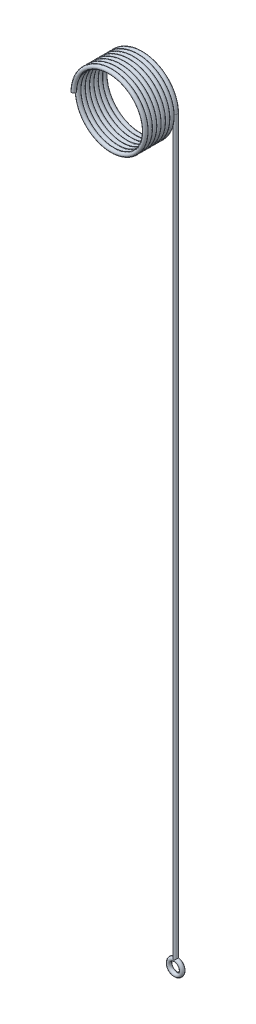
from build123d import *

# Parameters (mm, degrees)
SWEEP_1_PITCH   = 1.066666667
SWEEP_1_HEIGHT  = 8
SWEEP_1_RADIUS  = 8.5
SKETCH_2_R      = 0.5
SKETCH_3_R      = 0.5
EXTRUDE_1_DEPTH = 180
SKETCH_5_R      = 0.5


with BuildPart() as part:
    # Sweep 1: sweep along a helix
    with BuildLine() as sweep_1_path:
        Helix(SWEEP_1_PITCH, SWEEP_1_HEIGHT, SWEEP_1_RADIUS, center=(0, 0, 0), direction=(0, 0, -1))
    # Sketch 2 → Sweep 1 (sweep)
    with BuildSketch(Plane(origin=(0, 0, 0), x_dir=(1, 0, 0), z_dir=(0, 1, 0))):
        with Locations((-8.5, 0)):
            Circle(SKETCH_2_R)
    sweep(path=sweep_1_path.line, is_frenet=True)

    # Sketch 3 → Extrude 1 (add)
    with BuildSketch(Plane(origin=(0, 0, 0), x_dir=(1, 0, 0), z_dir=(0, 1, 0))):
        with Locations(Location((8.5, 8, 0), (0, 0, 270))):
            Circle(SKETCH_3_R)
    extrude(amount=-EXTRUDE_1_DEPTH)

    # Sweep 2: sweep along a path in Sketch 4
    with BuildLine(Plane.XY.offset(-8)) as sweep_2_path:
        CenterArc((8.5, -181.6), 1.6, 0, 360)
    # Sketch 5 → Sweep 2 (sweep)
    with BuildSketch(Plane(origin=(0, -181.6, 0), x_dir=(-1, 0, 0), z_dir=(0, 1, 0))):
        with Locations((-6.9, -8)):
            Circle(SKETCH_5_R)
    sweep(path=sweep_2_path.line)


solid = part.part
